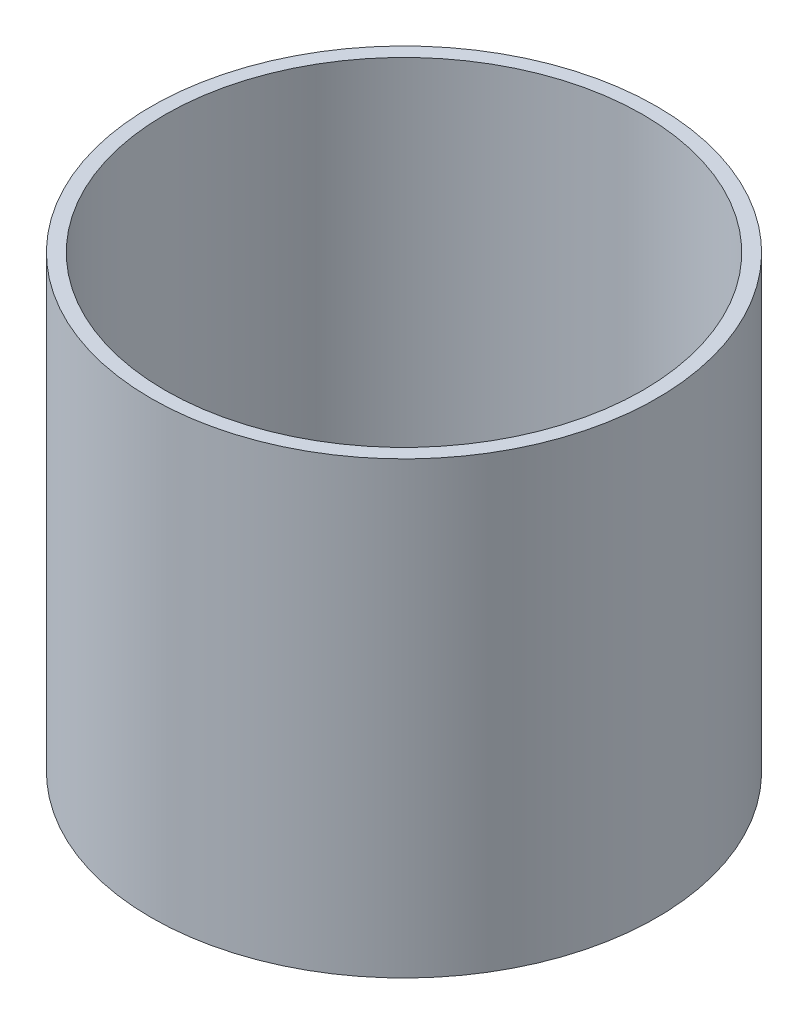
ISO-10303-21;
HEADER;
FILE_DESCRIPTION(('STEP AP214'),'2;1');
FILE_NAME('part.step','',(''),(''),'','','');
FILE_SCHEMA(('AUTOMOTIVE_DESIGN { 1 0 10303 214 1 1 1 1 }'));
ENDSEC;
DATA;
#1=APPLICATION_CONTEXT('core data for automotive mechanical design processes');
#2=APPLICATION_PROTOCOL_DEFINITION('international standard','automotive_design',2000,#1);
#3=PRODUCT_CONTEXT('',#1,'mechanical');
#4=PRODUCT('Part','Part','',(#3));
#5=PRODUCT_RELATED_PRODUCT_CATEGORY('part','',(#4));
#6=PRODUCT_DEFINITION_FORMATION('','',#4);
#7=PRODUCT_DEFINITION_CONTEXT('part definition',#1,'design');
#8=PRODUCT_DEFINITION('design','',#6,#7);
#9=PRODUCT_DEFINITION_SHAPE('','',#8);
#10=(LENGTH_UNIT() NAMED_UNIT(*) SI_UNIT(.MILLI.,.METRE.));
#11=(NAMED_UNIT(*) PLANE_ANGLE_UNIT() SI_UNIT($,.RADIAN.));
#12=(NAMED_UNIT(*) SI_UNIT($,.STERADIAN.) SOLID_ANGLE_UNIT());
#13=UNCERTAINTY_MEASURE_WITH_UNIT(LENGTH_MEASURE(1.E-05),#10,'distance_accuracy_value','');
#14=(GEOMETRIC_REPRESENTATION_CONTEXT(3) GLOBAL_UNCERTAINTY_ASSIGNED_CONTEXT((#13)) GLOBAL_UNIT_ASSIGNED_CONTEXT((#10,
#11,#12)) REPRESENTATION_CONTEXT('',''));
#15=CARTESIAN_POINT('',(0.,0.,0.));
#16=DIRECTION('',(0.,0.,1.));
#17=DIRECTION('',(1.,0.,0.));
#18=AXIS2_PLACEMENT_3D('',#15,#16,#17);
#19=CARTESIAN_POINT('',(0.,160.,0.));
#20=DIRECTION('',(0.,1.,0.));
#21=DIRECTION('',(0.,0.,1.));
#22=AXIS2_PLACEMENT_3D('',#19,#20,#21);
#23=PLANE('',#22);
#24=CARTESIAN_POINT('',(0.,160.,0.));
#25=DIRECTION('',(0.,1.,0.));
#26=DIRECTION('',(0.,0.,1.));
#27=AXIS2_PLACEMENT_3D('',#24,#25,#26);
#28=CIRCLE('',#27,90.);
#29=CARTESIAN_POINT('',(0.,160.,90.));
#30=VERTEX_POINT('',#29);
#31=EDGE_CURVE('E10',#30,#30,#28,.T.);
#32=ORIENTED_EDGE('',*,*,#31,.T.);
#33=EDGE_LOOP('',(#32));
#34=FACE_BOUND('',#33,.T.);
#35=CARTESIAN_POINT('',(0.,160.,0.));
#36=DIRECTION('',(0.,1.,0.));
#37=DIRECTION('',(0.,0.,1.));
#38=AXIS2_PLACEMENT_3D('',#35,#36,#37);
#39=CIRCLE('',#38,85.);
#40=CARTESIAN_POINT('',(0.,160.,85.));
#41=VERTEX_POINT('',#40);
#42=EDGE_CURVE('E46',#41,#41,#39,.T.);
#43=ORIENTED_EDGE('',*,*,#42,.F.);
#44=EDGE_LOOP('',(#43));
#45=FACE_BOUND('',#44,.T.);
#46=ADVANCED_FACE('F35',(#34,#45),#23,.T.);
#47=CARTESIAN_POINT('',(0.,0.,0.));
#48=DIRECTION('',(0.,1.,0.));
#49=DIRECTION('',(0.,0.,1.));
#50=AXIS2_PLACEMENT_3D('',#47,#48,#49);
#51=PLANE('',#50);
#52=CARTESIAN_POINT('',(0.,0.,0.));
#53=DIRECTION('',(0.,1.,0.));
#54=DIRECTION('',(0.,0.,1.));
#55=AXIS2_PLACEMENT_3D('',#52,#53,#54);
#56=CIRCLE('',#55,90.);
#57=CARTESIAN_POINT('',(0.,0.,90.));
#58=VERTEX_POINT('',#57);
#59=EDGE_CURVE('E39',#58,#58,#56,.T.);
#60=ORIENTED_EDGE('',*,*,#59,.F.);
#61=EDGE_LOOP('',(#60));
#62=FACE_BOUND('',#61,.T.);
#63=CARTESIAN_POINT('',(0.,0.,0.));
#64=DIRECTION('',(0.,1.,0.));
#65=DIRECTION('',(0.,0.,1.));
#66=AXIS2_PLACEMENT_3D('',#63,#64,#65);
#67=CIRCLE('',#66,85.);
#68=CARTESIAN_POINT('',(0.,0.,85.));
#69=VERTEX_POINT('',#68);
#70=EDGE_CURVE('E48',#69,#69,#67,.T.);
#71=ORIENTED_EDGE('',*,*,#70,.T.);
#72=EDGE_LOOP('',(#71));
#73=FACE_BOUND('',#72,.T.);
#74=ADVANCED_FACE('F58',(#62,#73),#51,.F.);
#75=CARTESIAN_POINT('',(0.,160.,0.));
#76=DIRECTION('',(0.,-1.,0.));
#77=DIRECTION('',(0.,0.,-1.));
#78=AXIS2_PLACEMENT_3D('',#75,#76,#77);
#79=CYLINDRICAL_SURFACE('',#78,90.);
#80=ORIENTED_EDGE('',*,*,#31,.F.);
#81=EDGE_LOOP('',(#80));
#82=FACE_BOUND('',#81,.T.);
#83=ORIENTED_EDGE('',*,*,#59,.T.);
#84=EDGE_LOOP('',(#83));
#85=FACE_BOUND('',#84,.T.);
#86=ADVANCED_FACE('F37',(#82,#85),#79,.T.);
#87=CARTESIAN_POINT('',(0.,160.,0.));
#88=DIRECTION('',(0.,-1.,0.));
#89=DIRECTION('',(0.,0.,-1.));
#90=AXIS2_PLACEMENT_3D('',#87,#88,#89);
#91=CYLINDRICAL_SURFACE('',#90,85.);
#92=ORIENTED_EDGE('',*,*,#42,.T.);
#93=EDGE_LOOP('',(#92));
#94=FACE_BOUND('',#93,.T.);
#95=ORIENTED_EDGE('',*,*,#70,.F.);
#96=EDGE_LOOP('',(#95));
#97=FACE_BOUND('',#96,.T.);
#98=ADVANCED_FACE('F54',(#94,#97),#91,.F.);
#99=CLOSED_SHELL('',(#46,#74,#86,#98));
#100=MANIFOLD_SOLID_BREP('B2',#99);
#101=ADVANCED_BREP_SHAPE_REPRESENTATION('',(#18,#100),#14);
#102=SHAPE_DEFINITION_REPRESENTATION(#9,#101);
ENDSEC;
END-ISO-10303-21;
